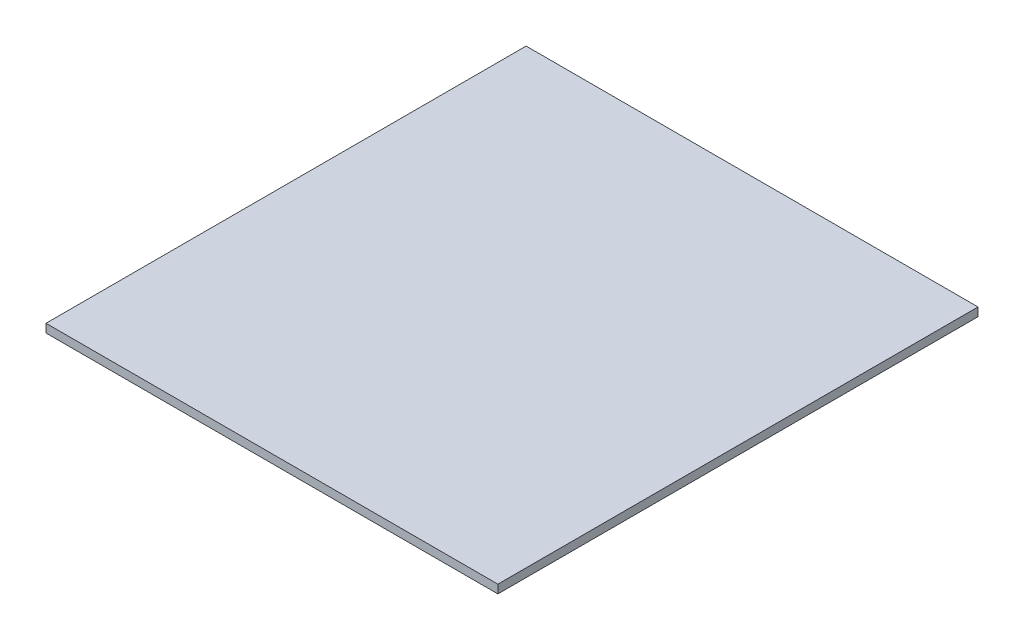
ISO-10303-21;
HEADER;
FILE_DESCRIPTION(('STEP AP214'),'2;1');
FILE_NAME('part.step','',(''),(''),'','','');
FILE_SCHEMA(('AUTOMOTIVE_DESIGN { 1 0 10303 214 1 1 1 1 }'));
ENDSEC;
DATA;
#1=APPLICATION_CONTEXT('core data for automotive mechanical design processes');
#2=APPLICATION_PROTOCOL_DEFINITION('international standard','automotive_design',2000,#1);
#3=PRODUCT_CONTEXT('',#1,'mechanical');
#4=PRODUCT('Part','Part','',(#3));
#5=PRODUCT_RELATED_PRODUCT_CATEGORY('part','',(#4));
#6=PRODUCT_DEFINITION_FORMATION('','',#4);
#7=PRODUCT_DEFINITION_CONTEXT('part definition',#1,'design');
#8=PRODUCT_DEFINITION('design','',#6,#7);
#9=PRODUCT_DEFINITION_SHAPE('','',#8);
#10=(LENGTH_UNIT() NAMED_UNIT(*) SI_UNIT(.MILLI.,.METRE.));
#11=(NAMED_UNIT(*) PLANE_ANGLE_UNIT() SI_UNIT($,.RADIAN.));
#12=(NAMED_UNIT(*) SI_UNIT($,.STERADIAN.) SOLID_ANGLE_UNIT());
#13=UNCERTAINTY_MEASURE_WITH_UNIT(LENGTH_MEASURE(1.E-05),#10,'distance_accuracy_value','');
#14=(GEOMETRIC_REPRESENTATION_CONTEXT(3) GLOBAL_UNCERTAINTY_ASSIGNED_CONTEXT((#13)) GLOBAL_UNIT_ASSIGNED_CONTEXT((#10,
#11,#12)) REPRESENTATION_CONTEXT('',''));
#15=CARTESIAN_POINT('',(0.,0.,0.));
#16=DIRECTION('',(0.,0.,1.));
#17=DIRECTION('',(1.,0.,0.));
#18=AXIS2_PLACEMENT_3D('',#15,#16,#17);
#19=CARTESIAN_POINT('',(320.,12.,340.));
#20=DIRECTION('',(-1.,0.,0.));
#21=DIRECTION('',(0.,0.,1.));
#22=AXIS2_PLACEMENT_3D('',#19,#20,#21);
#23=PLANE('',#22);
#24=DIRECTION('',(0.,0.,-1.));
#25=VECTOR('',#24,1.);
#26=CARTESIAN_POINT('',(320.,0.,340.));
#27=LINE('',#26,#25);
#28=CARTESIAN_POINT('',(320.,0.,340.));
#29=VERTEX_POINT('',#28);
#30=CARTESIAN_POINT('',(320.,0.,-340.));
#31=VERTEX_POINT('',#30);
#32=EDGE_CURVE('E98',#29,#31,#27,.T.);
#33=ORIENTED_EDGE('',*,*,#32,.T.);
#34=DIRECTION('',(0.,-1.,0.));
#35=VECTOR('',#34,1.);
#36=CARTESIAN_POINT('',(320.,12.,-340.));
#37=LINE('',#36,#35);
#38=CARTESIAN_POINT('',(320.,12.,-340.));
#39=VERTEX_POINT('',#38);
#40=EDGE_CURVE('E11',#39,#31,#37,.T.);
#41=ORIENTED_EDGE('',*,*,#40,.F.);
#42=DIRECTION('',(0.,0.,-1.));
#43=VECTOR('',#42,1.);
#44=CARTESIAN_POINT('',(320.,12.,340.));
#45=LINE('',#44,#43);
#46=CARTESIAN_POINT('',(320.,12.,340.));
#47=VERTEX_POINT('',#46);
#48=EDGE_CURVE('E86',#47,#39,#45,.T.);
#49=ORIENTED_EDGE('',*,*,#48,.F.);
#50=DIRECTION('',(0.,-1.,0.));
#51=VECTOR('',#50,1.);
#52=CARTESIAN_POINT('',(320.,12.,340.));
#53=LINE('',#52,#51);
#54=EDGE_CURVE('E94',#47,#29,#53,.T.);
#55=ORIENTED_EDGE('',*,*,#54,.T.);
#56=EDGE_LOOP('',(#33,#41,#49,#55));
#57=FACE_BOUND('',#56,.T.);
#58=ADVANCED_FACE('F35',(#57),#23,.F.);
#59=CARTESIAN_POINT('',(-320.,12.,-340.));
#60=DIRECTION('',(0.,0.,1.));
#61=DIRECTION('',(1.,0.,0.));
#62=AXIS2_PLACEMENT_3D('',#59,#60,#61);
#63=PLANE('',#62);
#64=DIRECTION('',(-1.,0.,0.));
#65=VECTOR('',#64,1.);
#66=CARTESIAN_POINT('',(-320.,0.,-340.));
#67=LINE('',#66,#65);
#68=CARTESIAN_POINT('',(-320.,0.,-340.));
#69=VERTEX_POINT('',#68);
#70=EDGE_CURVE('E90',#31,#69,#67,.T.);
#71=ORIENTED_EDGE('',*,*,#70,.T.);
#72=DIRECTION('',(0.,-1.,0.));
#73=VECTOR('',#72,1.);
#74=CARTESIAN_POINT('',(-320.,12.,-340.));
#75=LINE('',#74,#73);
#76=CARTESIAN_POINT('',(-320.,12.,-340.));
#77=VERTEX_POINT('',#76);
#78=EDGE_CURVE('E43',#77,#69,#75,.T.);
#79=ORIENTED_EDGE('',*,*,#78,.F.);
#80=DIRECTION('',(-1.,0.,0.));
#81=VECTOR('',#80,1.);
#82=CARTESIAN_POINT('',(-320.,12.,-340.));
#83=LINE('',#82,#81);
#84=EDGE_CURVE('E81',#39,#77,#83,.T.);
#85=ORIENTED_EDGE('',*,*,#84,.F.);
#86=ORIENTED_EDGE('',*,*,#40,.T.);
#87=EDGE_LOOP('',(#71,#79,#85,#86));
#88=FACE_BOUND('',#87,.T.);
#89=ADVANCED_FACE('F89',(#88),#63,.F.);
#90=CARTESIAN_POINT('',(-320.,12.,340.));
#91=DIRECTION('',(1.,0.,0.));
#92=DIRECTION('',(0.,0.,-1.));
#93=AXIS2_PLACEMENT_3D('',#90,#91,#92);
#94=PLANE('',#93);
#95=DIRECTION('',(0.,0.,1.));
#96=VECTOR('',#95,1.);
#97=CARTESIAN_POINT('',(-320.,0.,340.));
#98=LINE('',#97,#96);
#99=CARTESIAN_POINT('',(-320.,0.,340.));
#100=VERTEX_POINT('',#99);
#101=EDGE_CURVE('E68',#69,#100,#98,.T.);
#102=ORIENTED_EDGE('',*,*,#101,.T.);
#103=DIRECTION('',(0.,-1.,0.));
#104=VECTOR('',#103,1.);
#105=CARTESIAN_POINT('',(-320.,12.,340.));
#106=LINE('',#105,#104);
#107=CARTESIAN_POINT('',(-320.,12.,340.));
#108=VERTEX_POINT('',#107);
#109=EDGE_CURVE('E91',#108,#100,#106,.T.);
#110=ORIENTED_EDGE('',*,*,#109,.F.);
#111=DIRECTION('',(0.,0.,1.));
#112=VECTOR('',#111,1.);
#113=CARTESIAN_POINT('',(-320.,12.,340.));
#114=LINE('',#113,#112);
#115=EDGE_CURVE('E84',#77,#108,#114,.T.);
#116=ORIENTED_EDGE('',*,*,#115,.F.);
#117=ORIENTED_EDGE('',*,*,#78,.T.);
#118=EDGE_LOOP('',(#102,#110,#116,#117));
#119=FACE_BOUND('',#118,.T.);
#120=ADVANCED_FACE('F92',(#119),#94,.F.);
#121=CARTESIAN_POINT('',(-320.,12.,340.));
#122=DIRECTION('',(0.,0.,-1.));
#123=DIRECTION('',(-1.,0.,0.));
#124=AXIS2_PLACEMENT_3D('',#121,#122,#123);
#125=PLANE('',#124);
#126=DIRECTION('',(1.,0.,0.));
#127=VECTOR('',#126,1.);
#128=CARTESIAN_POINT('',(-320.,0.,340.));
#129=LINE('',#128,#127);
#130=EDGE_CURVE('E74',#100,#29,#129,.T.);
#131=ORIENTED_EDGE('',*,*,#130,.T.);
#132=ORIENTED_EDGE('',*,*,#54,.F.);
#133=DIRECTION('',(1.,0.,0.));
#134=VECTOR('',#133,1.);
#135=CARTESIAN_POINT('',(-320.,12.,340.));
#136=LINE('',#135,#134);
#137=EDGE_CURVE('E51',#108,#47,#136,.T.);
#138=ORIENTED_EDGE('',*,*,#137,.F.);
#139=ORIENTED_EDGE('',*,*,#109,.T.);
#140=EDGE_LOOP('',(#131,#132,#138,#139));
#141=FACE_BOUND('',#140,.T.);
#142=ADVANCED_FACE('F105',(#141),#125,.F.);
#143=CARTESIAN_POINT('',(0.,12.,0.));
#144=DIRECTION('',(0.,-1.,0.));
#145=DIRECTION('',(0.,0.,-1.));
#146=AXIS2_PLACEMENT_3D('',#143,#144,#145);
#147=PLANE('',#146);
#148=ORIENTED_EDGE('',*,*,#48,.T.);
#149=ORIENTED_EDGE('',*,*,#84,.T.);
#150=ORIENTED_EDGE('',*,*,#115,.T.);
#151=ORIENTED_EDGE('',*,*,#137,.T.);
#152=EDGE_LOOP('',(#148,#149,#150,#151));
#153=FACE_BOUND('',#152,.T.);
#154=ADVANCED_FACE('F82',(#153),#147,.F.);
#155=CARTESIAN_POINT('',(0.,0.,0.));
#156=DIRECTION('',(0.,-1.,0.));
#157=DIRECTION('',(0.,0.,-1.));
#158=AXIS2_PLACEMENT_3D('',#155,#156,#157);
#159=PLANE('',#158);
#160=ORIENTED_EDGE('',*,*,#32,.F.);
#161=ORIENTED_EDGE('',*,*,#130,.F.);
#162=ORIENTED_EDGE('',*,*,#101,.F.);
#163=ORIENTED_EDGE('',*,*,#70,.F.);
#164=EDGE_LOOP('',(#160,#161,#162,#163));
#165=FACE_BOUND('',#164,.T.);
#166=ADVANCED_FACE('F108',(#165),#159,.T.);
#167=CLOSED_SHELL('',(#58,#89,#120,#142,#154,#166));
#168=MANIFOLD_SOLID_BREP('B2',#167);
#169=ADVANCED_BREP_SHAPE_REPRESENTATION('',(#18,#168),#14);
#170=SHAPE_DEFINITION_REPRESENTATION(#9,#169);
ENDSEC;
END-ISO-10303-21;
